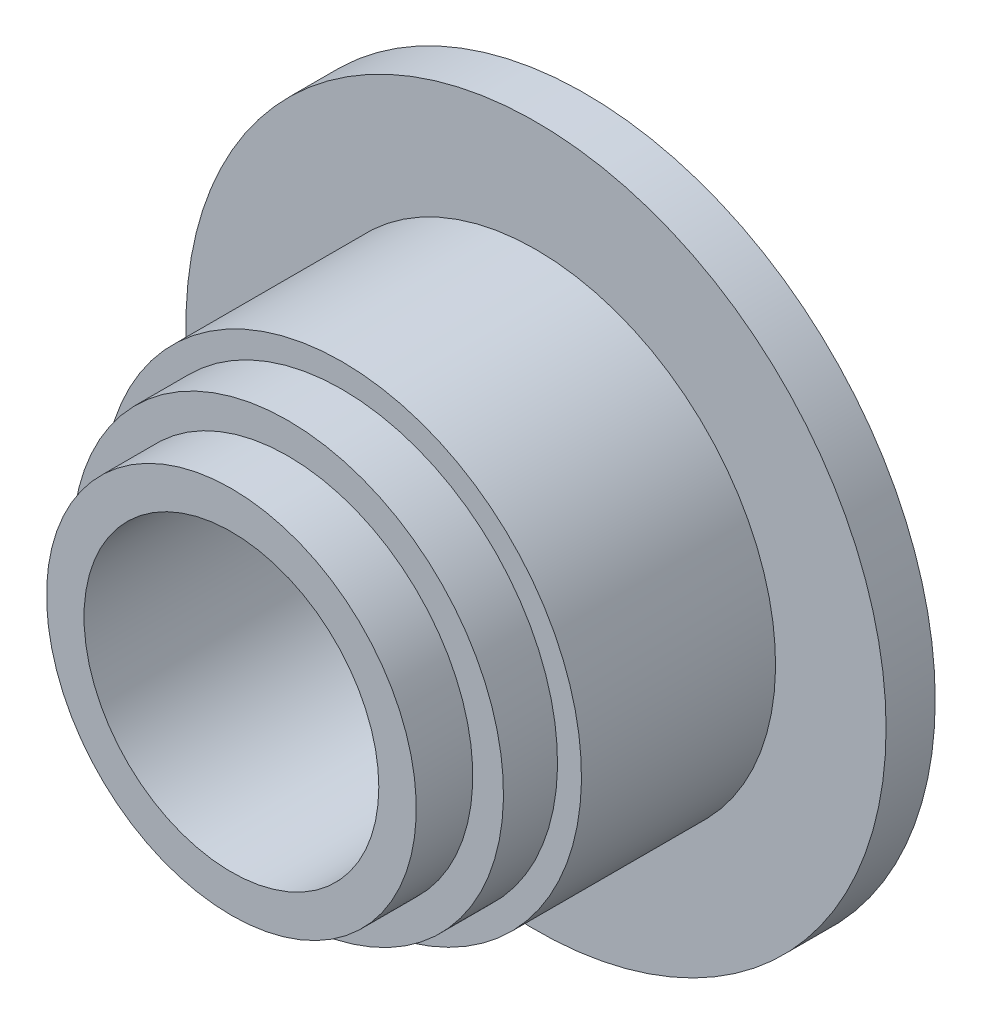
ISO-10303-21;
HEADER;
FILE_DESCRIPTION(('STEP AP214'),'2;1');
FILE_NAME('part.step','',(''),(''),'','','');
FILE_SCHEMA(('AUTOMOTIVE_DESIGN { 1 0 10303 214 1 1 1 1 }'));
ENDSEC;
DATA;
#1=APPLICATION_CONTEXT('core data for automotive mechanical design processes');
#2=APPLICATION_PROTOCOL_DEFINITION('international standard','automotive_design',2000,#1);
#3=PRODUCT_CONTEXT('',#1,'mechanical');
#4=PRODUCT('Part','Part','',(#3));
#5=PRODUCT_RELATED_PRODUCT_CATEGORY('part','',(#4));
#6=PRODUCT_DEFINITION_FORMATION('','',#4);
#7=PRODUCT_DEFINITION_CONTEXT('part definition',#1,'design');
#8=PRODUCT_DEFINITION('design','',#6,#7);
#9=PRODUCT_DEFINITION_SHAPE('','',#8);
#10=(LENGTH_UNIT() NAMED_UNIT(*) SI_UNIT(.MILLI.,.METRE.));
#11=(NAMED_UNIT(*) PLANE_ANGLE_UNIT() SI_UNIT($,.RADIAN.));
#12=(NAMED_UNIT(*) SI_UNIT($,.STERADIAN.) SOLID_ANGLE_UNIT());
#13=UNCERTAINTY_MEASURE_WITH_UNIT(LENGTH_MEASURE(1.E-05),#10,'distance_accuracy_value','');
#14=(GEOMETRIC_REPRESENTATION_CONTEXT(3) GLOBAL_UNCERTAINTY_ASSIGNED_CONTEXT((#13)) GLOBAL_UNIT_ASSIGNED_CONTEXT((#10,
#11,#12)) REPRESENTATION_CONTEXT('',''));
#15=CARTESIAN_POINT('',(0.,0.,0.));
#16=DIRECTION('',(0.,0.,1.));
#17=DIRECTION('',(1.,0.,0.));
#18=AXIS2_PLACEMENT_3D('',#15,#16,#17);
#19=CARTESIAN_POINT('',(71.335507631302,235.492600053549,63.8571843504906));
#20=DIRECTION('',(0.,0.,1.));
#21=DIRECTION('',(0.,1.,0.));
#22=AXIS2_PLACEMENT_3D('',#19,#20,#21);
#23=PLANE('',#22);
#24=CARTESIAN_POINT('',(-4.91449236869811,311.742600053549,63.8571843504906));
#25=DIRECTION('',(0.,0.,1.));
#26=DIRECTION('',(1.,0.,0.));
#27=AXIS2_PLACEMENT_3D('',#24,#25,#26);
#28=CIRCLE('',#27,60.);
#29=CARTESIAN_POINT('',(55.0855076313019,311.742600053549,63.8571843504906));
#30=VERTEX_POINT('',#29);
#31=EDGE_CURVE('E18',#30,#30,#28,.T.);
#32=ORIENTED_EDGE('',*,*,#31,.F.);
#33=EDGE_LOOP('',(#32));
#34=FACE_BOUND('',#33,.T.);
#35=CARTESIAN_POINT('',(-4.91449236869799,311.742600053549,63.8571843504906));
#36=DIRECTION('',(0.,0.,1.));
#37=DIRECTION('',(1.,0.,0.));
#38=AXIS2_PLACEMENT_3D('',#35,#36,#37);
#39=CIRCLE('',#38,75.25);
#40=CARTESIAN_POINT('',(-4.91449236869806,386.992600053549,63.8571843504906));
#41=VERTEX_POINT('',#40);
#42=EDGE_CURVE('E9',#41,#41,#39,.T.);
#43=ORIENTED_EDGE('',*,*,#42,.T.);
#44=EDGE_LOOP('',(#43));
#45=FACE_BOUND('',#44,.T.);
#46=ADVANCED_FACE('F14',(#34,#45),#23,.T.);
#47=CARTESIAN_POINT('',(-4.91449236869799,311.742600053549,63.8571843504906));
#48=DIRECTION('',(0.,0.,-1.));
#49=DIRECTION('',(-1.,0.,0.));
#50=AXIS2_PLACEMENT_3D('',#47,#48,#49);
#51=CYLINDRICAL_SURFACE('',#50,75.25);
#52=ORIENTED_EDGE('',*,*,#42,.F.);
#53=DIRECTION('',(0.,0.,1.));
#54=VECTOR('',#53,1.);
#55=CARTESIAN_POINT('',(-4.91449236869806,386.992600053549,52.3571843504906));
#56=LINE('',#55,#54);
#57=CARTESIAN_POINT('',(-4.91449236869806,386.992600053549,40.8571843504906));
#58=VERTEX_POINT('',#57);
#59=EDGE_CURVE('E61',#58,#41,#56,.T.);
#60=ORIENTED_EDGE('',*,*,#59,.F.);
#61=CARTESIAN_POINT('',(-4.91449236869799,311.742600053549,40.8571843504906));
#62=DIRECTION('',(0.,0.,1.));
#63=DIRECTION('',(1.,0.,0.));
#64=AXIS2_PLACEMENT_3D('',#61,#62,#63);
#65=CIRCLE('',#64,75.25);
#66=EDGE_CURVE('E24',#58,#58,#65,.T.);
#67=ORIENTED_EDGE('',*,*,#66,.T.);
#68=ORIENTED_EDGE('',*,*,#59,.T.);
#69=EDGE_LOOP('',(#52,#60,#67,#68));
#70=FACE_BOUND('',#69,.T.);
#71=ADVANCED_FACE('F63',(#70),#51,.T.);
#72=CARTESIAN_POINT('',(-97.0519930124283,219.605099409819,40.8571843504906));
#73=DIRECTION('',(0.,0.,1.));
#74=DIRECTION('',(1.,0.,0.));
#75=AXIS2_PLACEMENT_3D('',#72,#73,#74);
#76=PLANE('',#75);
#77=ORIENTED_EDGE('',*,*,#66,.F.);
#78=EDGE_LOOP('',(#77));
#79=FACE_BOUND('',#78,.T.);
#80=CARTESIAN_POINT('',(-4.91449236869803,311.742600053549,40.8571843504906));
#81=DIRECTION('',(0.,0.,1.));
#82=DIRECTION('',(1.,0.,0.));
#83=AXIS2_PLACEMENT_3D('',#80,#81,#82);
#84=CIRCLE('',#83,87.75);
#85=CARTESIAN_POINT('',(-4.91449236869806,399.492600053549,40.8571843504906));
#86=VERTEX_POINT('',#85);
#87=EDGE_CURVE('E64',#86,#86,#84,.T.);
#88=ORIENTED_EDGE('',*,*,#87,.T.);
#89=EDGE_LOOP('',(#88));
#90=FACE_BOUND('',#89,.T.);
#91=ADVANCED_FACE('F67',(#79,#90),#76,.T.);
#92=CARTESIAN_POINT('',(-4.91449236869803,311.742600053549,41.8571843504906));
#93=DIRECTION('',(0.,0.,-1.));
#94=DIRECTION('',(-1.,0.,0.));
#95=AXIS2_PLACEMENT_3D('',#92,#93,#94);
#96=CYLINDRICAL_SURFACE('',#95,87.75);
#97=ORIENTED_EDGE('',*,*,#87,.F.);
#98=DIRECTION('',(0.,0.,1.));
#99=VECTOR('',#98,1.);
#100=CARTESIAN_POINT('',(-4.91449236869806,399.492600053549,29.8571843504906));
#101=LINE('',#100,#99);
#102=CARTESIAN_POINT('',(-4.91449236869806,399.492600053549,18.8571843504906));
#103=VERTEX_POINT('',#102);
#104=EDGE_CURVE('E76',#103,#86,#101,.T.);
#105=ORIENTED_EDGE('',*,*,#104,.F.);
#106=CARTESIAN_POINT('',(-4.91449236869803,311.742600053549,18.8571843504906));
#107=DIRECTION('',(0.,0.,1.));
#108=DIRECTION('',(1.,0.,0.));
#109=AXIS2_PLACEMENT_3D('',#106,#107,#108);
#110=CIRCLE('',#109,87.75);
#111=EDGE_CURVE('E73',#103,#103,#110,.T.);
#112=ORIENTED_EDGE('',*,*,#111,.T.);
#113=ORIENTED_EDGE('',*,*,#104,.T.);
#114=EDGE_LOOP('',(#97,#105,#112,#113));
#115=FACE_BOUND('',#114,.T.);
#116=ADVANCED_FACE('F153',(#115),#96,.T.);
#117=CARTESIAN_POINT('',(-107.289485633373,209.367606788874,18.8571843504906));
#118=DIRECTION('',(0.,0.,1.));
#119=DIRECTION('',(1.,0.,0.));
#120=AXIS2_PLACEMENT_3D('',#117,#118,#119);
#121=PLANE('',#120);
#122=ORIENTED_EDGE('',*,*,#111,.F.);
#123=EDGE_LOOP('',(#122));
#124=FACE_BOUND('',#123,.T.);
#125=CARTESIAN_POINT('',(-4.91449236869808,311.742600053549,18.8571843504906));
#126=DIRECTION('',(0.,0.,1.));
#127=DIRECTION('',(1.,0.,0.));
#128=AXIS2_PLACEMENT_3D('',#125,#126,#127);
#129=CIRCLE('',#128,97.4999999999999);
#130=CARTESIAN_POINT('',(-4.91449236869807,409.242600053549,18.8571843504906));
#131=VERTEX_POINT('',#130);
#132=EDGE_CURVE('E79',#131,#131,#129,.T.);
#133=ORIENTED_EDGE('',*,*,#132,.T.);
#134=EDGE_LOOP('',(#133));
#135=FACE_BOUND('',#134,.T.);
#136=ADVANCED_FACE('F139',(#124,#135),#121,.T.);
#137=CARTESIAN_POINT('',(-4.91449236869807,311.742600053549,19.8571843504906));
#138=DIRECTION('',(0.,0.,-1.));
#139=DIRECTION('',(-1.,0.,0.));
#140=AXIS2_PLACEMENT_3D('',#137,#138,#139);
#141=CYLINDRICAL_SURFACE('',#140,97.5);
#142=ORIENTED_EDGE('',*,*,#132,.F.);
#143=DIRECTION('',(0.,0.,1.));
#144=VECTOR('',#143,1.);
#145=CARTESIAN_POINT('',(-4.91449236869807,409.242600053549,-20.6428156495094));
#146=LINE('',#145,#144);
#147=CARTESIAN_POINT('',(-4.91449236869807,409.242600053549,-60.1428156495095));
#148=VERTEX_POINT('',#147);
#149=EDGE_CURVE('E85',#148,#131,#146,.T.);
#150=ORIENTED_EDGE('',*,*,#149,.F.);
#151=CARTESIAN_POINT('',(-4.91449236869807,311.742600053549,-60.1428156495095));
#152=DIRECTION('',(0.,0.,1.));
#153=DIRECTION('',(1.,0.,0.));
#154=AXIS2_PLACEMENT_3D('',#151,#152,#153);
#155=CIRCLE('',#154,97.5);
#156=EDGE_CURVE('E82',#148,#148,#155,.T.);
#157=ORIENTED_EDGE('',*,*,#156,.T.);
#158=ORIENTED_EDGE('',*,*,#149,.T.);
#159=EDGE_LOOP('',(#142,#150,#157,#158));
#160=FACE_BOUND('',#159,.T.);
#161=ADVANCED_FACE('F130',(#160),#141,.T.);
#162=CARTESIAN_POINT('',(-154.539480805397,162.11761161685,-60.1428156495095));
#163=DIRECTION('',(0.,0.,1.));
#164=DIRECTION('',(1.,0.,0.));
#165=AXIS2_PLACEMENT_3D('',#162,#163,#164);
#166=PLANE('',#165);
#167=ORIENTED_EDGE('',*,*,#156,.F.);
#168=EDGE_LOOP('',(#167));
#169=FACE_BOUND('',#168,.T.);
#170=CARTESIAN_POINT('',(-4.91449236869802,311.742600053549,-60.1428156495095));
#171=DIRECTION('',(0.,0.,-1.));
#172=DIRECTION('',(0.,1.,0.));
#173=AXIS2_PLACEMENT_3D('',#170,#171,#172);
#174=CIRCLE('',#173,142.5);
#175=CARTESIAN_POINT('',(137.585507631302,311.742600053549,-60.1428156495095));
#176=VERTEX_POINT('',#175);
#177=EDGE_CURVE('E87',#176,#176,#174,.T.);
#178=ORIENTED_EDGE('',*,*,#177,.F.);
#179=EDGE_LOOP('',(#178));
#180=FACE_BOUND('',#179,.T.);
#181=ADVANCED_FACE('F128',(#169,#180),#166,.T.);
#182=CARTESIAN_POINT('',(-4.91449236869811,311.742600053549,-86.1428156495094));
#183=DIRECTION('',(0.,0.,1.));
#184=DIRECTION('',(1.,0.,0.));
#185=AXIS2_PLACEMENT_3D('',#182,#183,#184);
#186=CYLINDRICAL_SURFACE('',#185,142.5);
#187=ORIENTED_EDGE('',*,*,#177,.T.);
#188=DIRECTION('',(0.,0.,-1.));
#189=VECTOR('',#188,1.);
#190=CARTESIAN_POINT('',(137.585507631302,311.742600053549,-70.1428156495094));
#191=LINE('',#190,#189);
#192=CARTESIAN_POINT('',(137.585507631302,311.742600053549,-80.1428156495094));
#193=VERTEX_POINT('',#192);
#194=EDGE_CURVE('E90',#176,#193,#191,.T.);
#195=ORIENTED_EDGE('',*,*,#194,.T.);
#196=CARTESIAN_POINT('',(-4.91449236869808,311.742600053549,-80.1428156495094));
#197=DIRECTION('',(0.,0.,1.));
#198=DIRECTION('',(0.,-1.,0.));
#199=AXIS2_PLACEMENT_3D('',#196,#197,#198);
#200=CIRCLE('',#199,142.5);
#201=EDGE_CURVE('E93',#193,#193,#200,.T.);
#202=ORIENTED_EDGE('',*,*,#201,.T.);
#203=ORIENTED_EDGE('',*,*,#194,.F.);
#204=EDGE_LOOP('',(#187,#195,#202,#203));
#205=FACE_BOUND('',#204,.T.);
#206=ADVANCED_FACE('F122',(#205),#186,.T.);
#207=CARTESIAN_POINT('',(-154.539480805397,162.11761161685,-80.1428156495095));
#208=DIRECTION('',(0.,0.,-1.));
#209=DIRECTION('',(0.,1.,0.));
#210=AXIS2_PLACEMENT_3D('',#207,#208,#209);
#211=PLANE('',#210);
#212=CARTESIAN_POINT('',(-4.91449236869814,311.742600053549,-80.1428156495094));
#213=DIRECTION('',(0.,0.,-1.));
#214=DIRECTION('',(0.,1.,0.));
#215=AXIS2_PLACEMENT_3D('',#212,#213,#214);
#216=CIRCLE('',#215,87.5);
#217=CARTESIAN_POINT('',(82.5855076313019,311.742600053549,-80.1428156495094));
#218=VERTEX_POINT('',#217);
#219=EDGE_CURVE('E96',#218,#218,#216,.T.);
#220=ORIENTED_EDGE('',*,*,#219,.F.);
#221=EDGE_LOOP('',(#220));
#222=FACE_BOUND('',#221,.T.);
#223=ORIENTED_EDGE('',*,*,#201,.F.);
#224=EDGE_LOOP('',(#223));
#225=FACE_BOUND('',#224,.T.);
#226=ADVANCED_FACE('F119',(#222,#225),#211,.T.);
#227=CARTESIAN_POINT('',(-4.91449236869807,311.742600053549,-86.1428156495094));
#228=DIRECTION('',(0.,0.,1.));
#229=DIRECTION('',(1.,0.,0.));
#230=AXIS2_PLACEMENT_3D('',#227,#228,#229);
#231=CYLINDRICAL_SURFACE('',#230,87.5);
#232=CARTESIAN_POINT('',(-4.91449236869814,311.742600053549,-86.1428156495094));
#233=DIRECTION('',(0.,0.,-1.));
#234=DIRECTION('',(-1.,0.,0.));
#235=AXIS2_PLACEMENT_3D('',#232,#233,#234);
#236=CIRCLE('',#235,87.5);
#237=CARTESIAN_POINT('',(82.5855076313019,311.742600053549,-86.1428156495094));
#238=VERTEX_POINT('',#237);
#239=EDGE_CURVE('E102',#238,#238,#236,.T.);
#240=ORIENTED_EDGE('',*,*,#239,.F.);
#241=DIRECTION('',(0.,0.,-1.));
#242=VECTOR('',#241,1.);
#243=CARTESIAN_POINT('',(82.5855076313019,311.742600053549,-83.1428156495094));
#244=LINE('',#243,#242);
#245=EDGE_CURVE('E99',#218,#238,#244,.T.);
#246=ORIENTED_EDGE('',*,*,#245,.F.);
#247=ORIENTED_EDGE('',*,*,#219,.T.);
#248=ORIENTED_EDGE('',*,*,#245,.T.);
#249=EDGE_LOOP('',(#240,#246,#247,#248));
#250=FACE_BOUND('',#249,.T.);
#251=ADVANCED_FACE('F114',(#250),#231,.T.);
#252=CARTESIAN_POINT('',(-93.4144923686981,400.242600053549,-86.1428156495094));
#253=DIRECTION('',(0.,0.,-1.));
#254=DIRECTION('',(1.,0.,0.));
#255=AXIS2_PLACEMENT_3D('',#252,#253,#254);
#256=PLANE('',#255);
#257=CARTESIAN_POINT('',(-4.91449236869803,311.742600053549,-86.1428156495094));
#258=DIRECTION('',(0.,0.,-1.));
#259=DIRECTION('',(-1.,0.,0.));
#260=AXIS2_PLACEMENT_3D('',#257,#258,#259);
#261=CIRCLE('',#260,60.);
#262=CARTESIAN_POINT('',(55.0855076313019,311.742600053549,-86.1428156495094));
#263=VERTEX_POINT('',#262);
#264=EDGE_CURVE('E105',#263,#263,#261,.T.);
#265=ORIENTED_EDGE('',*,*,#264,.F.);
#266=EDGE_LOOP('',(#265));
#267=FACE_BOUND('',#266,.T.);
#268=ORIENTED_EDGE('',*,*,#239,.T.);
#269=EDGE_LOOP('',(#268));
#270=FACE_BOUND('',#269,.T.);
#271=ADVANCED_FACE('F111',(#267,#270),#256,.T.);
#272=CARTESIAN_POINT('',(-4.91449236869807,311.742600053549,-86.1428156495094));
#273=DIRECTION('',(0.,0.,1.));
#274=DIRECTION('',(1.,0.,0.));
#275=AXIS2_PLACEMENT_3D('',#272,#273,#274);
#276=CYLINDRICAL_SURFACE('',#275,60.);
#277=ORIENTED_EDGE('',*,*,#264,.T.);
#278=DIRECTION('',(0.,0.,1.));
#279=VECTOR('',#278,1.);
#280=CARTESIAN_POINT('',(55.0855076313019,311.742600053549,-11.1428156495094));
#281=LINE('',#280,#279);
#282=EDGE_CURVE('E107',#263,#30,#281,.T.);
#283=ORIENTED_EDGE('',*,*,#282,.T.);
#284=ORIENTED_EDGE('',*,*,#31,.T.);
#285=ORIENTED_EDGE('',*,*,#282,.F.);
#286=EDGE_LOOP('',(#277,#283,#284,#285));
#287=FACE_BOUND('',#286,.T.);
#288=ADVANCED_FACE('F16',(#287),#276,.F.);
#289=CLOSED_SHELL('',(#46,#71,#91,#116,#136,#161,#181,#206,#226,#251,#271,#288));
#290=MANIFOLD_SOLID_BREP('B1',#289);
#291=ADVANCED_BREP_SHAPE_REPRESENTATION('',(#18,#290),#14);
#292=SHAPE_DEFINITION_REPRESENTATION(#9,#291);
ENDSEC;
END-ISO-10303-21;
